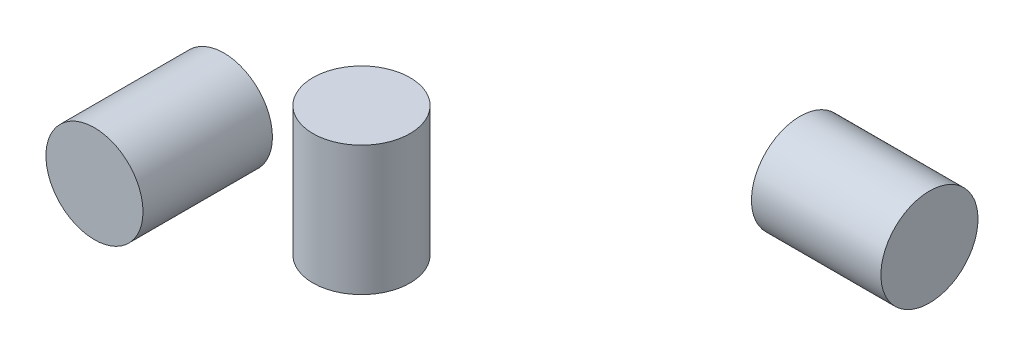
from build123d import *

# Parameters (mm, degrees)
SKETCH_1_R      = 15
EXTRUDE_1_DEPTH = 40
SKETCH_3_R      = 15
EXTRUDE_2_DEPTH = 40
SKETCH_4_R      = 15
EXTRUDE_3_DEPTH = 40


with BuildPart() as part:
    # Sketch 1 → Extrude 1 (new body)
    with BuildSketch(Plane.XY):
        Circle(SKETCH_1_R)
    extrude(amount=EXTRUDE_1_DEPTH)


with BuildPart() as body_2:
    # Sketch 3 → Extrude 2 (new body)
    with BuildSketch(Plane(origin=(0, 0, 0), x_dir=(1, 0, 0), z_dir=(0, 1, 0))):
        with Locations(Location((60.342843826, -17.819989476, 0), (0, 0, 270))):
            Circle(SKETCH_3_R)
    extrude(amount=EXTRUDE_2_DEPTH)


with BuildPart() as body_3:
    # Sketch 4 → Extrude 3 (new body)
    with BuildSketch(Plane(origin=(0, 0, 0), x_dir=(0, 0, -1), z_dir=(1, 0, 0))):
        with Locations((178.032193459, -105.951273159)):
            Circle(SKETCH_4_R)
    extrude(amount=EXTRUDE_3_DEPTH)


solid = Compound([part.part, body_2.part, body_3.part])
